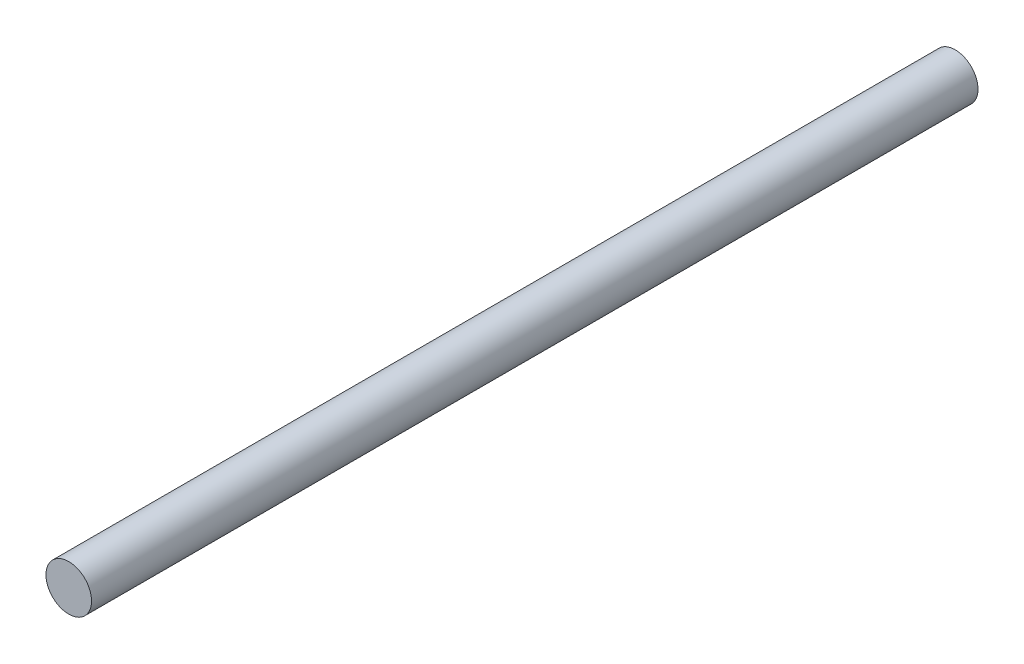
ISO-10303-21;
HEADER;
FILE_DESCRIPTION(('STEP AP214'),'2;1');
FILE_NAME('part.step','',(''),(''),'','','');
FILE_SCHEMA(('AUTOMOTIVE_DESIGN { 1 0 10303 214 1 1 1 1 }'));
ENDSEC;
DATA;
#1=APPLICATION_CONTEXT('core data for automotive mechanical design processes');
#2=APPLICATION_PROTOCOL_DEFINITION('international standard','automotive_design',2000,#1);
#3=PRODUCT_CONTEXT('',#1,'mechanical');
#4=PRODUCT('Part','Part','',(#3));
#5=PRODUCT_RELATED_PRODUCT_CATEGORY('part','',(#4));
#6=PRODUCT_DEFINITION_FORMATION('','',#4);
#7=PRODUCT_DEFINITION_CONTEXT('part definition',#1,'design');
#8=PRODUCT_DEFINITION('design','',#6,#7);
#9=PRODUCT_DEFINITION_SHAPE('','',#8);
#10=(LENGTH_UNIT() NAMED_UNIT(*) SI_UNIT(.MILLI.,.METRE.));
#11=(NAMED_UNIT(*) PLANE_ANGLE_UNIT() SI_UNIT($,.RADIAN.));
#12=(NAMED_UNIT(*) SI_UNIT($,.STERADIAN.) SOLID_ANGLE_UNIT());
#13=UNCERTAINTY_MEASURE_WITH_UNIT(LENGTH_MEASURE(1.E-05),#10,'distance_accuracy_value','');
#14=(GEOMETRIC_REPRESENTATION_CONTEXT(3) GLOBAL_UNCERTAINTY_ASSIGNED_CONTEXT((#13)) GLOBAL_UNIT_ASSIGNED_CONTEXT((#10,
#11,#12)) REPRESENTATION_CONTEXT('',''));
#15=CARTESIAN_POINT('',(0.,0.,0.));
#16=DIRECTION('',(0.,0.,1.));
#17=DIRECTION('',(1.,0.,0.));
#18=AXIS2_PLACEMENT_3D('',#15,#16,#17);
#19=CARTESIAN_POINT('',(0.,0.,88.9));
#20=DIRECTION('',(0.,0.,-1.));
#21=DIRECTION('',(-1.,0.,0.));
#22=AXIS2_PLACEMENT_3D('',#19,#20,#21);
#23=CYLINDRICAL_SURFACE('',#22,4.572);
#24=CARTESIAN_POINT('',(0.,0.,88.9));
#25=DIRECTION('',(0.,0.,1.));
#26=DIRECTION('',(1.,0.,0.));
#27=AXIS2_PLACEMENT_3D('',#24,#25,#26);
#28=CIRCLE('',#27,4.572);
#29=CARTESIAN_POINT('',(4.57200000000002,0.,88.9));
#30=VERTEX_POINT('',#29);
#31=EDGE_CURVE('E10',#30,#30,#28,.T.);
#32=ORIENTED_EDGE('',*,*,#31,.F.);
#33=EDGE_LOOP('',(#32));
#34=FACE_BOUND('',#33,.T.);
#35=CARTESIAN_POINT('',(0.,0.,-88.9));
#36=DIRECTION('',(0.,0.,1.));
#37=DIRECTION('',(1.,0.,0.));
#38=AXIS2_PLACEMENT_3D('',#35,#36,#37);
#39=CIRCLE('',#38,4.572);
#40=CARTESIAN_POINT('',(4.57200000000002,0.,-88.9));
#41=VERTEX_POINT('',#40);
#42=EDGE_CURVE('E31',#41,#41,#39,.T.);
#43=ORIENTED_EDGE('',*,*,#42,.T.);
#44=EDGE_LOOP('',(#43));
#45=FACE_BOUND('',#44,.T.);
#46=ADVANCED_FACE('F28',(#34,#45),#23,.T.);
#47=CARTESIAN_POINT('',(-2.4980018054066E-13,-21.0964213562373,88.9));
#48=DIRECTION('',(0.,0.,1.));
#49=DIRECTION('',(1.,0.,0.));
#50=AXIS2_PLACEMENT_3D('',#47,#48,#49);
#51=PLANE('',#50);
#52=ORIENTED_EDGE('',*,*,#31,.T.);
#53=EDGE_LOOP('',(#52));
#54=FACE_BOUND('',#53,.T.);
#55=ADVANCED_FACE('F43',(#54),#51,.T.);
#56=CARTESIAN_POINT('',(-2.4980018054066E-13,-21.0964213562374,-88.9));
#57=DIRECTION('',(0.,0.,1.));
#58=DIRECTION('',(1.,0.,0.));
#59=AXIS2_PLACEMENT_3D('',#56,#57,#58);
#60=PLANE('',#59);
#61=ORIENTED_EDGE('',*,*,#42,.F.);
#62=EDGE_LOOP('',(#61));
#63=FACE_BOUND('',#62,.T.);
#64=ADVANCED_FACE('F41',(#63),#60,.F.);
#65=CLOSED_SHELL('',(#46,#55,#64));
#66=MANIFOLD_SOLID_BREP('B2',#65);
#67=ADVANCED_BREP_SHAPE_REPRESENTATION('',(#18,#66),#14);
#68=SHAPE_DEFINITION_REPRESENTATION(#9,#67);
ENDSEC;
END-ISO-10303-21;
